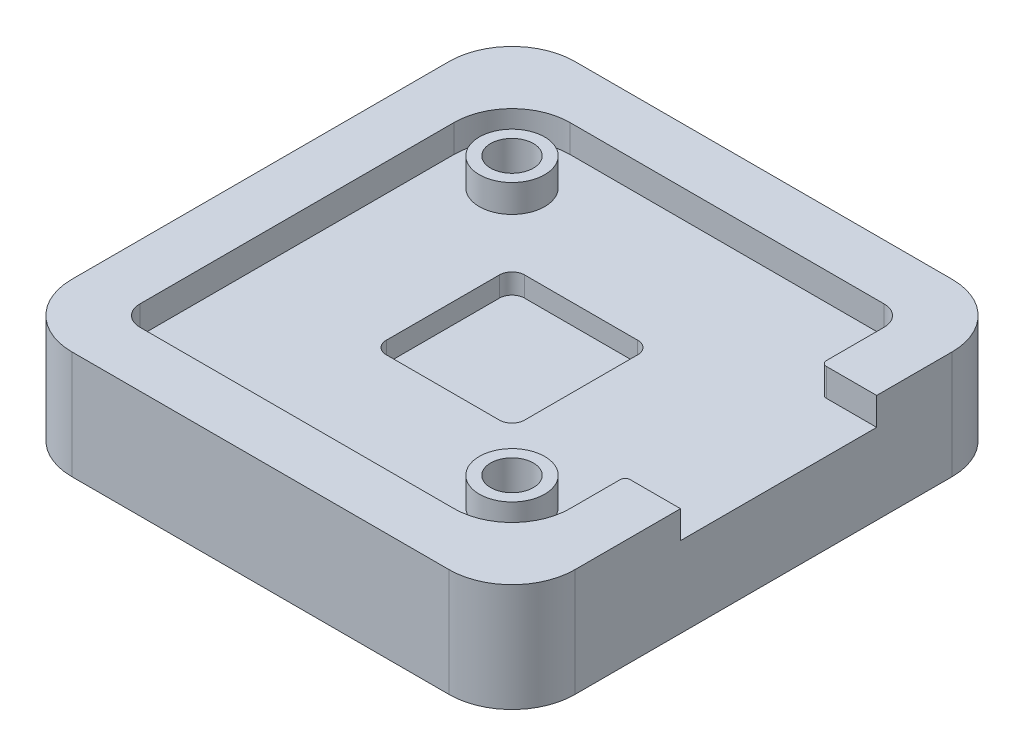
from build123d import *

# Parameters (mm, degrees)
BOSS_EXTRUDE1_DEPTH                                  = 4.3
SKETCH2_R                                            = 1.3
CUT_EXTRUDE1_DEPTH                                   = 1.1
SKETCH5_W                                            = 7.8
SKETCH5_H                                            = 3
CUT_EXTRUDE3_DEPTH                                   = 2.2
CBORE_FOR_M1_6_HEX_SOCKET_HEAD_CAP_SCREW_D           = 1.7
CBORE_FOR_M1_6_HEX_SOCKET_HEAD_CAP_SCREW_CBORE_D     = 3.5
CBORE_FOR_M1_6_HEX_SOCKET_HEAD_CAP_SCREW_CBORE_DEPTH = 2
FILLET1_R                                            = 0.2
CUT_EXTRUDE4_DEPTH                                   = 0.8


with BuildPart() as part:
    # Sketch1 → Boss-Extrude1 (new body)
    with BuildSketch(Plane(origin=(0, 0, 0), x_dir=(1, 0, 0), z_dir=(0, 1, 0))):
        with BuildLine():
            Line((-7.5, -10), (7.5, -10))
            ThreePointArc((7.5, -10), (9.267766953, -9.267766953), (10, -7.5))
            Line((10, -7.5), (10, 7.5))
            ThreePointArc((10, 7.5), (9.267766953, 9.267766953), (7.5, 10))
            Line((7.5, 10), (-7.5, 10))
            ThreePointArc((-7.5, 10), (-9.267766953, 9.267766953), (-10, 7.5))
            Line((-10, 7.5), (-10, -7.5))
            ThreePointArc((-10, -7.5), (-9.267766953, -9.267766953), (-7.5, -10))
        make_face()
    extrude(amount=BOSS_EXTRUDE1_DEPTH)

    # Sketch2 → Cut-Extrude1 (cut)
    with BuildSketch(Plane(origin=(0, 4.3, 0), x_dir=(1, 0, 0), z_dir=(0, 1, 0))):
        with BuildLine():
            Line((7, 7.8), (-5.5, 7.8))
            ThreePointArc((-5.5, 7.8), (-7.126345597, 7.126345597), (-7.8, 5.5))
            Line((-7.8, 5.5), (-7.8, -7))
            ThreePointArc((-7.8, -7), (-7.565685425, -7.565685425), (-7, -7.8))
            Line((-7, -7.8), (5.5, -7.8))
            ThreePointArc((5.5, -7.8), (7.126345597, -7.126345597), (7.8, -5.5))
            Line((7.8, -5.5), (7.8, 7))
            ThreePointArc((7.8, 7), (7.565685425, 7.565685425), (7, 7.8))
        make_face()
        with Locations(Location((-5.5, 5.5, 0), (0, 0, 270))):
            Circle(SKETCH2_R, mode=Mode.SUBTRACT)
        with Locations(Location((5.5, -5.5, 0), (0, 0, 270))):
            Circle(SKETCH2_R, mode=Mode.SUBTRACT)
    extrude(amount=-CUT_EXTRUDE1_DEPTH, mode=Mode.SUBTRACT)

    # Sketch5 → Cut-Extrude3 (cut)
    with BuildSketch(Plane(origin=(10, 0, 0), x_dir=(0, 0, -1), z_dir=(1, 0, 0))):
        with Locations((0.6, 4.7)):
            Rectangle(SKETCH5_W, SKETCH5_H)
    extrude(amount=-CUT_EXTRUDE3_DEPTH, mode=Mode.SUBTRACT)

    # CBORE for M1.6 Hex Socket Head Cap Screw (through all)
    with Locations(Plane(origin=(0, 0, 0), x_dir=(-1, 0, 0), z_dir=(0, -1, 0))):
        with Locations((-5.5, -5.5), (5.5, 5.5)):
            CounterBoreHole(CBORE_FOR_M1_6_HEX_SOCKET_HEAD_CAP_SCREW_D / 2, CBORE_FOR_M1_6_HEX_SOCKET_HEAD_CAP_SCREW_CBORE_D / 2, CBORE_FOR_M1_6_HEX_SOCKET_HEAD_CAP_SCREW_CBORE_DEPTH)

    # Fillet1
    fillet1_edges = [part.edges().sort_by_distance(p)[0] for p in [
        (7.8, 3.75, 3.3),
        (7.8, 3.75, -4.5),
    ]]
    fillet(fillet1_edges, radius=FILLET1_R)

    # Sketch8 → Cut-Extrude4 (cut)
    with BuildSketch(Plane(origin=(0, 3.2, 0), x_dir=(1, 0, 0), z_dir=(0, 1, 0))):
        with BuildLine():
            Line((2.25, -2.75), (-2.25, -2.75))
            ThreePointArc((-2.25, -2.75), (-2.603553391, -2.603553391), (-2.75, -2.25))
            Line((-2.75, -2.25), (-2.75, 2.25))
            ThreePointArc((-2.75, 2.25), (-2.603553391, 2.603553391), (-2.25, 2.75))
            Line((-2.25, 2.75), (2.25, 2.75))
            ThreePointArc((2.25, 2.75), (2.603553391, 2.603553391), (2.75, 2.25))
            Line((2.75, 2.25), (2.75, -2.25))
            ThreePointArc((2.75, -2.25), (2.603553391, -2.603553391), (2.25, -2.75))
        make_face()
    extrude(amount=-CUT_EXTRUDE4_DEPTH, mode=Mode.SUBTRACT)


solid = part.part
